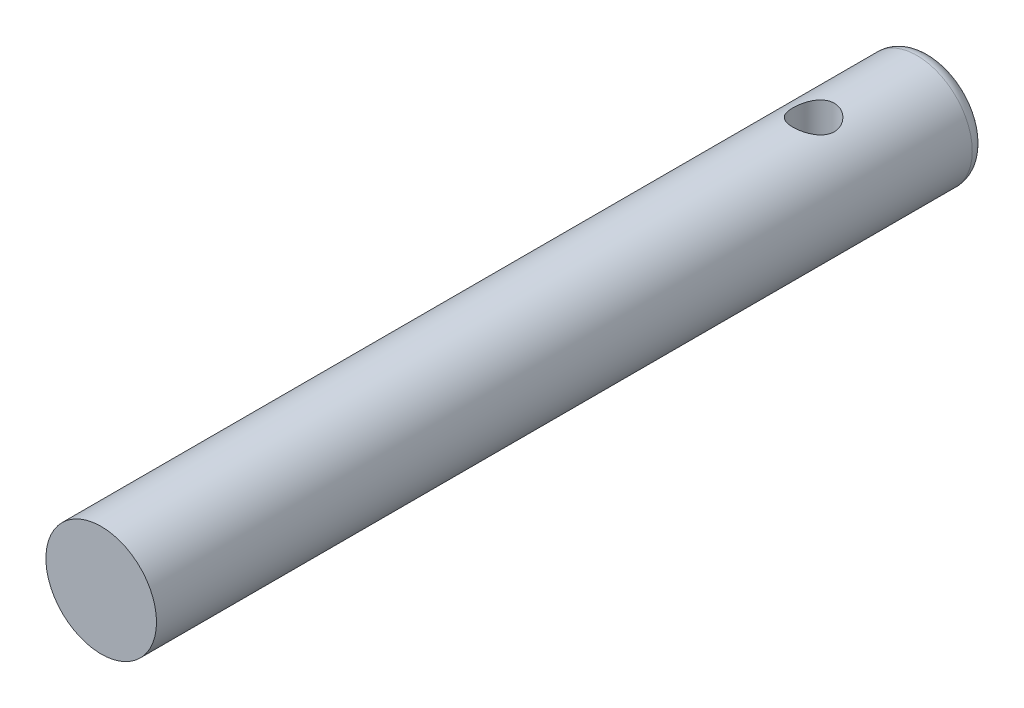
ISO-10303-21;
HEADER;
FILE_DESCRIPTION(('STEP AP214'),'2;1');
FILE_NAME('part.step','',(''),(''),'','','');
FILE_SCHEMA(('AUTOMOTIVE_DESIGN { 1 0 10303 214 1 1 1 1 }'));
ENDSEC;
DATA;
#1=APPLICATION_CONTEXT('core data for automotive mechanical design processes');
#2=APPLICATION_PROTOCOL_DEFINITION('international standard','automotive_design',2000,#1);
#3=PRODUCT_CONTEXT('',#1,'mechanical');
#4=PRODUCT('Part','Part','',(#3));
#5=PRODUCT_RELATED_PRODUCT_CATEGORY('part','',(#4));
#6=PRODUCT_DEFINITION_FORMATION('','',#4);
#7=PRODUCT_DEFINITION_CONTEXT('part definition',#1,'design');
#8=PRODUCT_DEFINITION('design','',#6,#7);
#9=PRODUCT_DEFINITION_SHAPE('','',#8);
#10=(LENGTH_UNIT() NAMED_UNIT(*) SI_UNIT(.MILLI.,.METRE.));
#11=(NAMED_UNIT(*) PLANE_ANGLE_UNIT() SI_UNIT($,.RADIAN.));
#12=(NAMED_UNIT(*) SI_UNIT($,.STERADIAN.) SOLID_ANGLE_UNIT());
#13=UNCERTAINTY_MEASURE_WITH_UNIT(LENGTH_MEASURE(1.E-05),#10,'distance_accuracy_value','');
#14=(GEOMETRIC_REPRESENTATION_CONTEXT(3) GLOBAL_UNCERTAINTY_ASSIGNED_CONTEXT((#13)) GLOBAL_UNIT_ASSIGNED_CONTEXT((#10,
#11,#12)) REPRESENTATION_CONTEXT('',''));
#15=CARTESIAN_POINT('',(0.,0.,0.));
#16=DIRECTION('',(0.,0.,1.));
#17=DIRECTION('',(1.,0.,0.));
#18=AXIS2_PLACEMENT_3D('',#15,#16,#17);
#19=CARTESIAN_POINT('',(0.,0.,60.));
#20=DIRECTION('',(0.,0.,-1.));
#21=DIRECTION('',(-1.,0.,0.));
#22=AXIS2_PLACEMENT_3D('',#19,#20,#21);
#23=CYLINDRICAL_SURFACE('',#22,4.);
#24=CARTESIAN_POINT('',(0.,0.,1.));
#25=DIRECTION('',(0.,0.,1.));
#26=DIRECTION('',(1.,0.,0.));
#27=AXIS2_PLACEMENT_3D('',#24,#25,#26);
#28=CIRCLE('',#27,4.);
#29=CARTESIAN_POINT('',(4.,0.,1.));
#30=VERTEX_POINT('',#29);
#31=EDGE_CURVE('E56',#30,#30,#28,.T.);
#32=ORIENTED_EDGE('',*,*,#31,.T.);
#33=EDGE_LOOP('',(#32));
#34=FACE_BOUND('',#33,.T.);
#35=CARTESIAN_POINT('',(0.,0.,60.));
#36=DIRECTION('',(0.,0.,1.));
#37=DIRECTION('',(1.,0.,0.));
#38=AXIS2_PLACEMENT_3D('',#35,#36,#37);
#39=CIRCLE('',#38,4.);
#40=CARTESIAN_POINT('',(4.,0.,60.));
#41=VERTEX_POINT('',#40);
#42=EDGE_CURVE('E62',#41,#41,#39,.T.);
#43=ORIENTED_EDGE('',*,*,#42,.F.);
#44=EDGE_LOOP('',(#43));
#45=FACE_BOUND('',#44,.T.);
#46=CARTESIAN_POINT('',(0.,-4.,6.98));
#47=CARTESIAN_POINT('',(0.0812350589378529,-4.00000217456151,6.97999709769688));
#48=CARTESIAN_POINT('',(0.162450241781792,-3.99750379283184,6.98661976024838));
#49=CARTESIAN_POINT('',(0.322453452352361,-3.98778696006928,7.01282819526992));
#50=CARTESIAN_POINT('',(0.401241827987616,-3.98056918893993,7.03241210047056));
#51=CARTESIAN_POINT('',(0.554060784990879,-3.96218832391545,7.08375300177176));
#52=CARTESIAN_POINT('',(0.628100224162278,-3.9510328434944,7.11548651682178));
#53=CARTESIAN_POINT('',(0.769799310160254,-3.92588767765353,7.19010641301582));
#54=CARTESIAN_POINT('',(0.837457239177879,-3.91189723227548,7.23299578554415));
#55=CARTESIAN_POINT('',(0.967346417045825,-3.88186246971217,7.3306125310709));
#56=CARTESIAN_POINT('',(1.02927073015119,-3.86576002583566,7.3857302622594));
#57=CARTESIAN_POINT('',(1.14324421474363,-3.83360220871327,7.50541043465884));
#58=CARTESIAN_POINT('',(1.19529036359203,-3.81754685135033,7.56997575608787));
#59=CARTESIAN_POINT('',(1.28998202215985,-3.78662470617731,7.7097174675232));
#60=CARTESIAN_POINT('',(1.3321939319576,-3.77182648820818,7.78520436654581));
#61=CARTESIAN_POINT('',(1.40318646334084,-3.74599860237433,7.94284835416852));
#62=CARTESIAN_POINT('',(1.43197244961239,-3.73496742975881,8.0250027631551));
#63=CARTESIAN_POINT('',(1.47408431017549,-3.71854412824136,8.19011674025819));
#64=CARTESIAN_POINT('',(1.48799593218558,-3.71293924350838,8.27290503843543));
#65=CARTESIAN_POINT('',(1.50179556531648,-3.70738061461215,8.43981615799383));
#66=CARTESIAN_POINT('',(1.5016893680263,-3.70742453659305,8.52393841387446));
#67=CARTESIAN_POINT('',(1.48790429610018,-3.71297511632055,8.68576952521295));
#68=CARTESIAN_POINT('',(1.47503808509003,-3.71815468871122,8.76356090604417));
#69=CARTESIAN_POINT('',(1.4374416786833,-3.7328493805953,8.91578715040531));
#70=CARTESIAN_POINT('',(1.41270969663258,-3.74236515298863,8.99022150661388));
#71=CARTESIAN_POINT('',(1.35163748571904,-3.76485702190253,9.13527706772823));
#72=CARTESIAN_POINT('',(1.31508648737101,-3.77789517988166,9.2057994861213));
#73=CARTESIAN_POINT('',(1.23156073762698,-3.80594210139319,9.33994573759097));
#74=CARTESIAN_POINT('',(1.18458238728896,-3.82095154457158,9.4035671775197));
#75=CARTESIAN_POINT('',(1.07781780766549,-3.85248038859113,9.52660366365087));
#76=CARTESIAN_POINT('',(1.01738298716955,-3.86903347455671,9.58544864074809));
#77=CARTESIAN_POINT('',(0.887312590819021,-3.90091728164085,9.69233796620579));
#78=CARTESIAN_POINT('',(0.817675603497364,-3.91624781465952,9.74038065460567));
#79=CARTESIAN_POINT('',(0.66972343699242,-3.9442639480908,9.82493039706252));
#80=CARTESIAN_POINT('',(0.591290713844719,-3.95690498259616,9.86124758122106));
#81=CARTESIAN_POINT('',(0.428836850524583,-3.97778718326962,9.91998260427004));
#82=CARTESIAN_POINT('',(0.344818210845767,-3.98603030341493,9.94240661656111));
#83=CARTESIAN_POINT('',(0.178375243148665,-3.99684443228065,9.97162278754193));
#84=CARTESIAN_POINT('',(0.096103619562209,-3.99969369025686,9.97918260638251));
#85=CARTESIAN_POINT('',(-0.0685724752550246,-4.00025893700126,9.98069106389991));
#86=CARTESIAN_POINT('',(-0.150976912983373,-3.99797606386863,9.97464272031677));
#87=CARTESIAN_POINT('',(-0.31026204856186,-3.98871709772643,9.94968995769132));
#88=CARTESIAN_POINT('',(-0.387233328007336,-3.98192470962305,9.93128845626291));
#89=CARTESIAN_POINT('',(-0.536941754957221,-3.96451477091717,9.88281392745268));
#90=CARTESIAN_POINT('',(-0.609678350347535,-3.9538967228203,9.85273938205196));
#91=CARTESIAN_POINT('',(-0.751247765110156,-3.92949624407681,9.78081358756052));
#92=CARTESIAN_POINT('',(-0.819903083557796,-3.91563000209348,9.73864227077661));
#93=CARTESIAN_POINT('',(-0.949392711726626,-3.88626671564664,9.64408189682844));
#94=CARTESIAN_POINT('',(-1.01022412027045,-3.87076907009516,9.59168906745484));
#95=CARTESIAN_POINT('',(-1.12603079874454,-3.8387332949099,9.47459587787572));
#96=CARTESIAN_POINT('',(-1.18046154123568,-3.82218696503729,9.4093578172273));
#97=CARTESIAN_POINT('',(-1.27771050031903,-3.79078815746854,9.27034861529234));
#98=CARTESIAN_POINT('',(-1.32052767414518,-3.77593583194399,9.1965767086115));
#99=CARTESIAN_POINT('',(-1.39337773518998,-3.74966829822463,9.04198401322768));
#100=CARTESIAN_POINT('',(-1.42335685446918,-3.73826760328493,8.96113525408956));
#101=CARTESIAN_POINT('',(-1.46907883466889,-3.72054032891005,8.79499023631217));
#102=CARTESIAN_POINT('',(-1.48483050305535,-3.71421061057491,8.70969676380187));
#103=CARTESIAN_POINT('',(-1.50086347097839,-3.70775894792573,8.54298384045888));
#104=CARTESIAN_POINT('',(-1.50207331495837,-3.70726444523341,8.46166736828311));
#105=CARTESIAN_POINT('',(-1.49136715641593,-3.71158412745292,8.30005468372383));
#106=CARTESIAN_POINT('',(-1.47945239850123,-3.71639780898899,8.21975837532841));
#107=CARTESIAN_POINT('',(-1.44355815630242,-3.73048141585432,8.06495277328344));
#108=CARTESIAN_POINT('',(-1.41995798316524,-3.73961085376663,7.99034165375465));
#109=CARTESIAN_POINT('',(-1.3616969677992,-3.76121548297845,7.84609449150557));
#110=CARTESIAN_POINT('',(-1.32703332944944,-3.77369151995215,7.77645971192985));
#111=CARTESIAN_POINT('',(-1.24552075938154,-3.80139723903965,7.64017321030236));
#112=CARTESIAN_POINT('',(-1.1981283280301,-3.81673698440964,7.57386920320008));
#113=CARTESIAN_POINT('',(-1.09334485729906,-3.84806246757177,7.44985843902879));
#114=CARTESIAN_POINT('',(-1.03595064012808,-3.86404840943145,7.39215442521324));
#115=CARTESIAN_POINT('',(-0.909080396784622,-3.89590424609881,7.28379804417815));
#116=CARTESIAN_POINT('',(-0.839118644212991,-3.91172104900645,7.23369624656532));
#117=CARTESIAN_POINT('',(-0.69121322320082,-3.94054514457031,7.14597734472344));
#118=CARTESIAN_POINT('',(-0.61326893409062,-3.95355221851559,7.10836121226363));
#119=CARTESIAN_POINT('',(-0.447999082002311,-3.9757429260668,7.04562317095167));
#120=CARTESIAN_POINT('',(-0.360413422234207,-3.98473657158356,7.0211129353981));
#121=CARTESIAN_POINT('',(-0.181875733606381,-3.99686242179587,6.98830704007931));
#122=CARTESIAN_POINT('',(-0.0909254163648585,-3.99999756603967,6.98000324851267));
#123=CARTESIAN_POINT('',(0.,-4.,6.98));
#124=B_SPLINE_CURVE_WITH_KNOTS('',3,(#46,#47,#48,#49,#50,#51,#52,#53,#54,#55,#56,#57,#58,#59,
#60,#61,#62,#63,#64,#65,#66,#67,#68,#69,#70,#71,#72,#73,#74,#75,#76,#77,#78,#79,#80,#81,#82,#83,
#84,#85,#86,#87,#88,#89,#90,#91,#92,#93,#94,#95,#96,#97,#98,#99,#100,#101,#102,#103,#104,#105,
#106,#107,#108,#109,#110,#111,#112,#113,#114,#115,#116,#117,#118,#119,#120,#121,#122,#123),
.UNSPECIFIED.,.T.,.F.,(4,2,2,2,2,2,2,2,2,2,2,2,2,2,2,2,2,2,2,2,2,2,2,2,2,2,2,2,2,2,2,2,2,2,2,2,
2,2,4),(0.,0.24336980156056,0.486704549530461,0.729571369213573,0.97250337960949,
1.22473618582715,1.47704604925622,1.73896674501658,2.00078269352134,2.25185874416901,
2.50283106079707,2.73878345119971,2.97477138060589,3.21522408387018,3.45575990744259,
3.71246153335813,3.96920257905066,4.22991375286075,4.49050899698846,4.73725019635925,
4.98393668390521,5.2211443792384,5.45838293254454,5.702592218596,5.94689180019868,
6.20536519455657,6.46386178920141,6.72343066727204,6.98283874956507,7.22558763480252,
7.46831350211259,7.70363142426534,7.93900886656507,8.18672471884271,8.43451941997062,
8.69572329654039,8.95694749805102,9.22948515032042,9.50188601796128),.UNSPECIFIED.);
#125=CARTESIAN_POINT('',(0.,-4.,6.98));
#126=VERTEX_POINT('',#125);
#127=EDGE_CURVE('E65',#126,#126,#124,.T.);
#128=ORIENTED_EDGE('',*,*,#127,.F.);
#129=EDGE_LOOP('',(#128));
#130=FACE_BOUND('',#129,.T.);
#131=CARTESIAN_POINT('',(0.,4.,6.98));
#132=CARTESIAN_POINT('',(-0.0812350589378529,4.00000217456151,6.97999709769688));
#133=CARTESIAN_POINT('',(-0.162450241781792,3.99750379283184,6.98661976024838));
#134=CARTESIAN_POINT('',(-0.322453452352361,3.98778696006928,7.01282819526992));
#135=CARTESIAN_POINT('',(-0.401241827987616,3.98056918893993,7.03241210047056));
#136=CARTESIAN_POINT('',(-0.554060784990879,3.96218832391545,7.08375300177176));
#137=CARTESIAN_POINT('',(-0.628100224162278,3.9510328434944,7.11548651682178));
#138=CARTESIAN_POINT('',(-0.769799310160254,3.92588767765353,7.19010641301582));
#139=CARTESIAN_POINT('',(-0.837457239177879,3.91189723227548,7.23299578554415));
#140=CARTESIAN_POINT('',(-0.967346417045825,3.88186246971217,7.3306125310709));
#141=CARTESIAN_POINT('',(-1.02927073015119,3.86576002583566,7.3857302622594));
#142=CARTESIAN_POINT('',(-1.14324421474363,3.83360220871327,7.50541043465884));
#143=CARTESIAN_POINT('',(-1.19529036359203,3.81754685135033,7.56997575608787));
#144=CARTESIAN_POINT('',(-1.28998202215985,3.78662470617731,7.7097174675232));
#145=CARTESIAN_POINT('',(-1.3321939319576,3.77182648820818,7.78520436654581));
#146=CARTESIAN_POINT('',(-1.40318646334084,3.74599860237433,7.94284835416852));
#147=CARTESIAN_POINT('',(-1.43197244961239,3.73496742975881,8.0250027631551));
#148=CARTESIAN_POINT('',(-1.47408431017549,3.71854412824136,8.19011674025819));
#149=CARTESIAN_POINT('',(-1.48799593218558,3.71293924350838,8.27290503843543));
#150=CARTESIAN_POINT('',(-1.50179556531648,3.70738061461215,8.43981615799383));
#151=CARTESIAN_POINT('',(-1.5016893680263,3.70742453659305,8.52393841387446));
#152=CARTESIAN_POINT('',(-1.48790429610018,3.71297511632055,8.68576952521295));
#153=CARTESIAN_POINT('',(-1.47503808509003,3.71815468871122,8.76356090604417));
#154=CARTESIAN_POINT('',(-1.4374416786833,3.7328493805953,8.91578715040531));
#155=CARTESIAN_POINT('',(-1.41270969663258,3.74236515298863,8.99022150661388));
#156=CARTESIAN_POINT('',(-1.35163748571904,3.76485702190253,9.13527706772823));
#157=CARTESIAN_POINT('',(-1.31508648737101,3.77789517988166,9.2057994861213));
#158=CARTESIAN_POINT('',(-1.23156073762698,3.80594210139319,9.33994573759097));
#159=CARTESIAN_POINT('',(-1.18458238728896,3.82095154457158,9.4035671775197));
#160=CARTESIAN_POINT('',(-1.07781780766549,3.85248038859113,9.52660366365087));
#161=CARTESIAN_POINT('',(-1.01738298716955,3.86903347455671,9.58544864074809));
#162=CARTESIAN_POINT('',(-0.887312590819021,3.90091728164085,9.69233796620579));
#163=CARTESIAN_POINT('',(-0.817675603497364,3.91624781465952,9.74038065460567));
#164=CARTESIAN_POINT('',(-0.66972343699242,3.9442639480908,9.82493039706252));
#165=CARTESIAN_POINT('',(-0.591290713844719,3.95690498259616,9.86124758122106));
#166=CARTESIAN_POINT('',(-0.428836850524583,3.97778718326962,9.91998260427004));
#167=CARTESIAN_POINT('',(-0.344818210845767,3.98603030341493,9.94240661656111));
#168=CARTESIAN_POINT('',(-0.178375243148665,3.99684443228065,9.97162278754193));
#169=CARTESIAN_POINT('',(-0.096103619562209,3.99969369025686,9.97918260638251));
#170=CARTESIAN_POINT('',(0.0685724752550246,4.00025893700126,9.98069106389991));
#171=CARTESIAN_POINT('',(0.150976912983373,3.99797606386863,9.97464272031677));
#172=CARTESIAN_POINT('',(0.31026204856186,3.98871709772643,9.94968995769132));
#173=CARTESIAN_POINT('',(0.387233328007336,3.98192470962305,9.93128845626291));
#174=CARTESIAN_POINT('',(0.536941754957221,3.96451477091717,9.88281392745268));
#175=CARTESIAN_POINT('',(0.609678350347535,3.9538967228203,9.85273938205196));
#176=CARTESIAN_POINT('',(0.751247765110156,3.92949624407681,9.78081358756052));
#177=CARTESIAN_POINT('',(0.819903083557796,3.91563000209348,9.73864227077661));
#178=CARTESIAN_POINT('',(0.949392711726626,3.88626671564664,9.64408189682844));
#179=CARTESIAN_POINT('',(1.01022412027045,3.87076907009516,9.59168906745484));
#180=CARTESIAN_POINT('',(1.12603079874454,3.8387332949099,9.47459587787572));
#181=CARTESIAN_POINT('',(1.18046154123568,3.82218696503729,9.4093578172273));
#182=CARTESIAN_POINT('',(1.27771050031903,3.79078815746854,9.27034861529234));
#183=CARTESIAN_POINT('',(1.32052767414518,3.77593583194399,9.1965767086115));
#184=CARTESIAN_POINT('',(1.39337773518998,3.74966829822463,9.04198401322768));
#185=CARTESIAN_POINT('',(1.42335685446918,3.73826760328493,8.96113525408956));
#186=CARTESIAN_POINT('',(1.46907883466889,3.72054032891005,8.79499023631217));
#187=CARTESIAN_POINT('',(1.48483050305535,3.71421061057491,8.70969676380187));
#188=CARTESIAN_POINT('',(1.50086347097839,3.70775894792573,8.54298384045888));
#189=CARTESIAN_POINT('',(1.50207331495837,3.70726444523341,8.46166736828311));
#190=CARTESIAN_POINT('',(1.49136715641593,3.71158412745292,8.30005468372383));
#191=CARTESIAN_POINT('',(1.47945239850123,3.71639780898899,8.21975837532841));
#192=CARTESIAN_POINT('',(1.44355815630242,3.73048141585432,8.06495277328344));
#193=CARTESIAN_POINT('',(1.41995798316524,3.73961085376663,7.99034165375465));
#194=CARTESIAN_POINT('',(1.3616969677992,3.76121548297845,7.84609449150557));
#195=CARTESIAN_POINT('',(1.32703332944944,3.77369151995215,7.77645971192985));
#196=CARTESIAN_POINT('',(1.24552075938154,3.80139723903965,7.64017321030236));
#197=CARTESIAN_POINT('',(1.1981283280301,3.81673698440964,7.57386920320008));
#198=CARTESIAN_POINT('',(1.09334485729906,3.84806246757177,7.44985843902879));
#199=CARTESIAN_POINT('',(1.03595064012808,3.86404840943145,7.39215442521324));
#200=CARTESIAN_POINT('',(0.909080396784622,3.89590424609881,7.28379804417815));
#201=CARTESIAN_POINT('',(0.839118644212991,3.91172104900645,7.23369624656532));
#202=CARTESIAN_POINT('',(0.69121322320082,3.94054514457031,7.14597734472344));
#203=CARTESIAN_POINT('',(0.61326893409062,3.95355221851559,7.10836121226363));
#204=CARTESIAN_POINT('',(0.447999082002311,3.9757429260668,7.04562317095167));
#205=CARTESIAN_POINT('',(0.360413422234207,3.98473657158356,7.0211129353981));
#206=CARTESIAN_POINT('',(0.181875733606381,3.99686242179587,6.98830704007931));
#207=CARTESIAN_POINT('',(0.0909254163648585,3.99999756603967,6.98000324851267));
#208=CARTESIAN_POINT('',(0.,4.,6.98));
#209=B_SPLINE_CURVE_WITH_KNOTS('',3,(#131,#132,#133,#134,#135,#136,#137,#138,#139,#140,#141,
#142,#143,#144,#145,#146,#147,#148,#149,#150,#151,#152,#153,#154,#155,#156,#157,#158,#159,#160,
#161,#162,#163,#164,#165,#166,#167,#168,#169,#170,#171,#172,#173,#174,#175,#176,#177,#178,#179,
#180,#181,#182,#183,#184,#185,#186,#187,#188,#189,#190,#191,#192,#193,#194,#195,#196,#197,#198,
#199,#200,#201,#202,#203,#204,#205,#206,#207,#208),.UNSPECIFIED.,.T.,.F.,(4,2,2,2,2,2,2,2,2,2,2,
2,2,2,2,2,2,2,2,2,2,2,2,2,2,2,2,2,2,2,2,2,2,2,2,2,2,2,4),(0.,0.24336980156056,0.486704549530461,
0.729571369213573,0.97250337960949,1.22473618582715,1.47704604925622,1.73896674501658,
2.00078269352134,2.25185874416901,2.50283106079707,2.73878345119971,2.97477138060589,
3.21522408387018,3.45575990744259,3.71246153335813,3.96920257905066,4.22991375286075,
4.49050899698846,4.73725019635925,4.98393668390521,5.2211443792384,5.45838293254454,
5.702592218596,5.94689180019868,6.20536519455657,6.46386178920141,6.72343066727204,
6.98283874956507,7.22558763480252,7.46831350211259,7.70363142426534,7.93900886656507,
8.18672471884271,8.43451941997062,8.69572329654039,8.95694749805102,9.22948515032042,
9.50188601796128),.UNSPECIFIED.);
#210=CARTESIAN_POINT('',(0.,4.,6.98));
#211=VERTEX_POINT('',#210);
#212=EDGE_CURVE('E47',#211,#211,#209,.T.);
#213=ORIENTED_EDGE('',*,*,#212,.F.);
#214=EDGE_LOOP('',(#213));
#215=FACE_BOUND('',#214,.T.);
#216=ADVANCED_FACE('F43',(#34,#45,#130,#215),#23,.T.);
#217=CARTESIAN_POINT('',(0.,0.,60.));
#218=DIRECTION('',(0.,0.,1.));
#219=DIRECTION('',(1.,0.,0.));
#220=AXIS2_PLACEMENT_3D('',#217,#218,#219);
#221=PLANE('',#220);
#222=ORIENTED_EDGE('',*,*,#42,.T.);
#223=EDGE_LOOP('',(#222));
#224=FACE_BOUND('',#223,.T.);
#225=ADVANCED_FACE('F78',(#224),#221,.T.);
#226=CARTESIAN_POINT('',(0.,0.,0.));
#227=DIRECTION('',(0.,0.,1.));
#228=DIRECTION('',(1.,0.,0.));
#229=AXIS2_PLACEMENT_3D('',#226,#227,#228);
#230=PLANE('',#229);
#231=CARTESIAN_POINT('',(0.,0.,0.));
#232=DIRECTION('',(0.,0.,1.));
#233=DIRECTION('',(1.,0.,0.));
#234=AXIS2_PLACEMENT_3D('',#231,#232,#233);
#235=CIRCLE('',#234,3.);
#236=CARTESIAN_POINT('',(3.,0.,0.));
#237=VERTEX_POINT('',#236);
#238=EDGE_CURVE('E10',#237,#237,#235,.F.);
#239=ORIENTED_EDGE('',*,*,#238,.T.);
#240=EDGE_LOOP('',(#239));
#241=FACE_BOUND('',#240,.T.);
#242=ADVANCED_FACE('F81',(#241),#230,.F.);
#243=CARTESIAN_POINT('',(0.,0.,1.));
#244=DIRECTION('',(0.,0.,1.));
#245=DIRECTION('',(1.,0.,0.));
#246=AXIS2_PLACEMENT_3D('',#243,#244,#245);
#247=TOROIDAL_SURFACE('',#246,3.,1.);
#248=ORIENTED_EDGE('',*,*,#238,.F.);
#249=EDGE_LOOP('',(#248));
#250=FACE_BOUND('',#249,.T.);
#251=ORIENTED_EDGE('',*,*,#31,.F.);
#252=EDGE_LOOP('',(#251));
#253=FACE_BOUND('',#252,.T.);
#254=ADVANCED_FACE('F45',(#250,#253),#247,.T.);
#255=CARTESIAN_POINT('',(0.,10.,8.48));
#256=DIRECTION('',(0.,-1.,0.));
#257=DIRECTION('',(0.,0.,-1.));
#258=AXIS2_PLACEMENT_3D('',#255,#256,#257);
#259=CYLINDRICAL_SURFACE('',#258,1.5);
#260=ORIENTED_EDGE('',*,*,#127,.T.);
#261=EDGE_LOOP('',(#260));
#262=FACE_BOUND('',#261,.T.);
#263=ORIENTED_EDGE('',*,*,#212,.T.);
#264=EDGE_LOOP('',(#263));
#265=FACE_BOUND('',#264,.T.);
#266=ADVANCED_FACE('F73',(#262,#265),#259,.F.);
#267=CLOSED_SHELL('',(#216,#225,#242,#254,#266));
#268=MANIFOLD_SOLID_BREP('B2',#267);
#269=ADVANCED_BREP_SHAPE_REPRESENTATION('',(#18,#268),#14);
#270=SHAPE_DEFINITION_REPRESENTATION(#9,#269);
ENDSEC;
END-ISO-10303-21;
